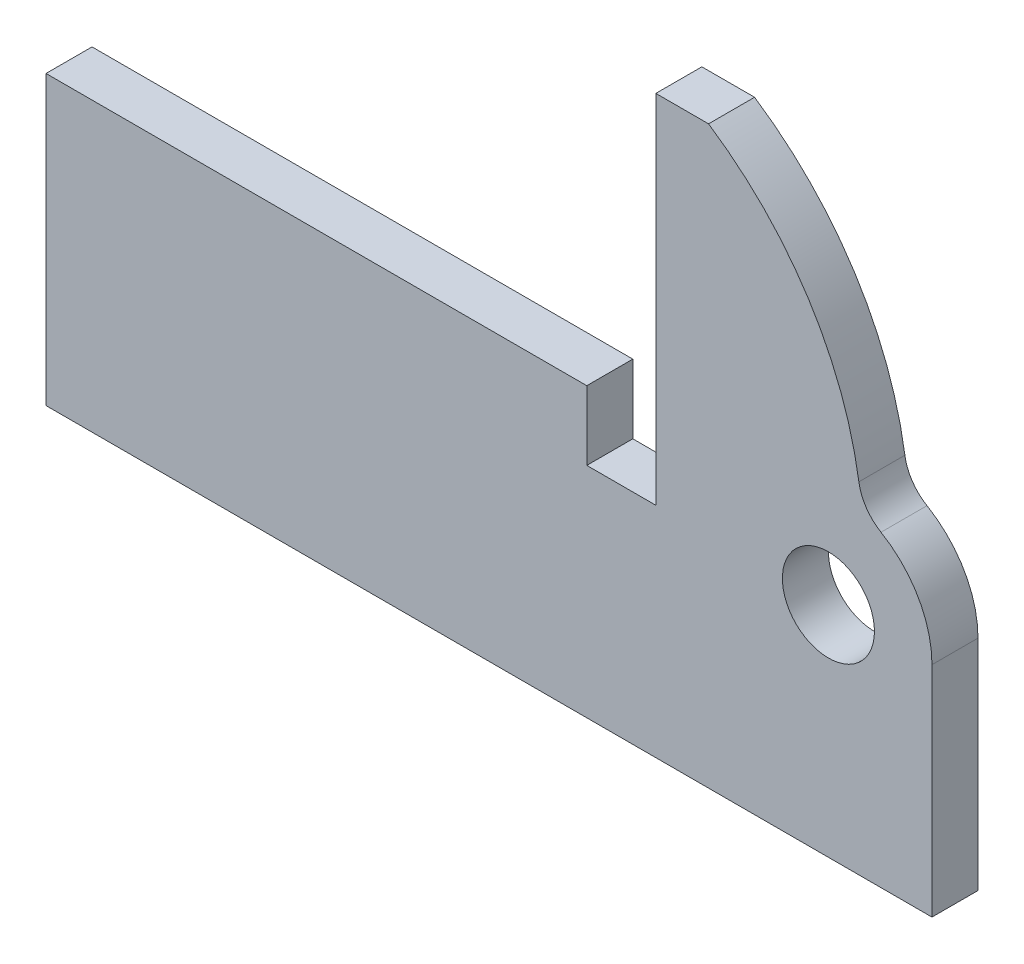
from build123d import *

# Parameters (mm, degrees)
SKETCH1_R           = 4
BOSS_EXTRUDE1_DEPTH = 4


with BuildPart() as part:
    # Sketch1 → Boss-Extrude1 (new body)
    with BuildSketch(Plane.XY):
        with BuildLine():
            Line((0, 0), (77, 0))
            Line((77, 0), (77, 19))
            ThreePointArc((77, 19), (75.814188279, 23.465250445), (72.569230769, 26.753846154))
            ThreePointArc((72.569230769, 26.753846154), (71.289465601, 27.954924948), (70.647058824, 29.588235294))
            ThreePointArc((70.647058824, 29.588235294), (66.26791413, 41.171966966), (57.583123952, 50))
            Line((57.583123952, 50), (53, 50))
            Line((53, 50), (53, 19))
            Line((53, 19), (47, 19))
            Line((47, 19), (47, 25))
            Line((47, 25), (0, 25))
            Line((0, 25), (0, 0))
        make_face()
        with Locations((68, 19)):
            Circle(SKETCH1_R, mode=Mode.SUBTRACT)
    extrude(amount=BOSS_EXTRUDE1_DEPTH)


solid = part.part
